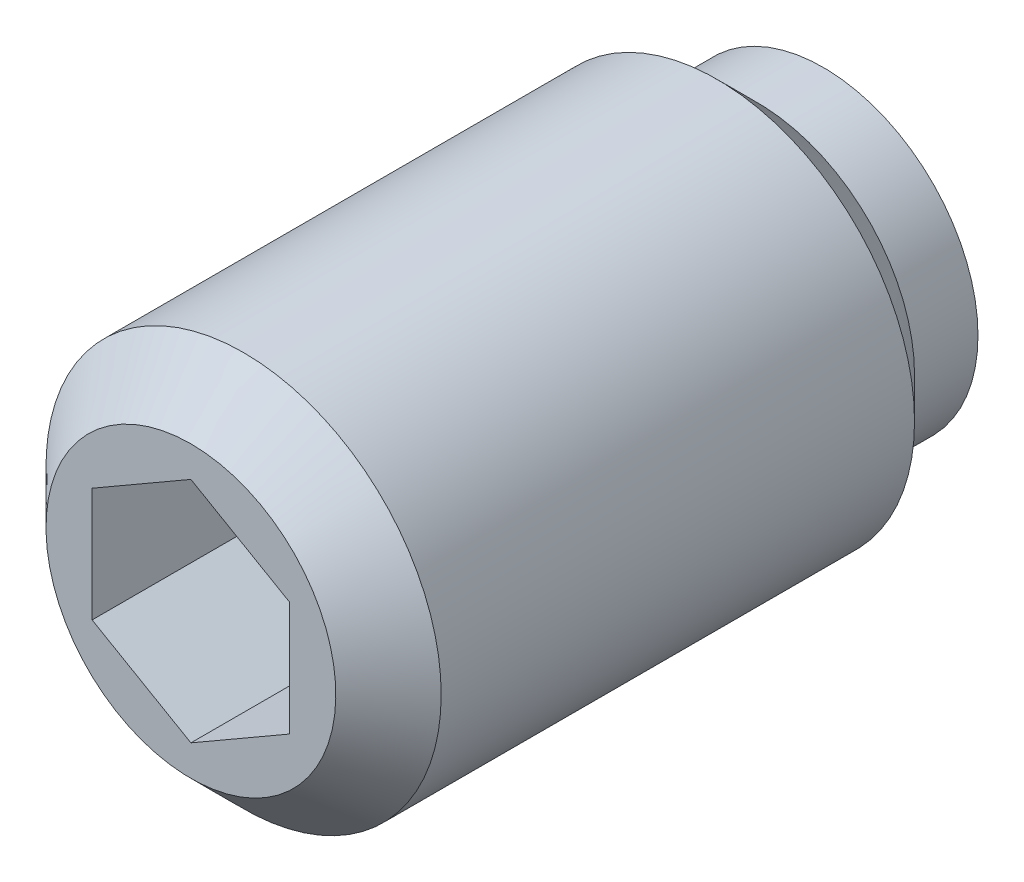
ISO-10303-21;
HEADER;
FILE_DESCRIPTION(('STEP AP214'),'2;1');
FILE_NAME('part.step','',(''),(''),'','','');
FILE_SCHEMA(('AUTOMOTIVE_DESIGN { 1 0 10303 214 1 1 1 1 }'));
ENDSEC;
DATA;
#1=APPLICATION_CONTEXT('core data for automotive mechanical design processes');
#2=APPLICATION_PROTOCOL_DEFINITION('international standard','automotive_design',2000,#1);
#3=PRODUCT_CONTEXT('',#1,'mechanical');
#4=PRODUCT('Part','Part','',(#3));
#5=PRODUCT_RELATED_PRODUCT_CATEGORY('part','',(#4));
#6=PRODUCT_DEFINITION_FORMATION('','',#4);
#7=PRODUCT_DEFINITION_CONTEXT('part definition',#1,'design');
#8=PRODUCT_DEFINITION('design','',#6,#7);
#9=PRODUCT_DEFINITION_SHAPE('','',#8);
#10=(LENGTH_UNIT() NAMED_UNIT(*) SI_UNIT(.MILLI.,.METRE.));
#11=(NAMED_UNIT(*) PLANE_ANGLE_UNIT() SI_UNIT($,.RADIAN.));
#12=(NAMED_UNIT(*) SI_UNIT($,.STERADIAN.) SOLID_ANGLE_UNIT());
#13=UNCERTAINTY_MEASURE_WITH_UNIT(LENGTH_MEASURE(1.E-05),#10,'distance_accuracy_value','');
#14=(GEOMETRIC_REPRESENTATION_CONTEXT(3) GLOBAL_UNCERTAINTY_ASSIGNED_CONTEXT((#13)) GLOBAL_UNIT_ASSIGNED_CONTEXT((#10,
#11,#12)) REPRESENTATION_CONTEXT('',''));
#15=CARTESIAN_POINT('',(0.,0.,0.));
#16=DIRECTION('',(0.,0.,1.));
#17=DIRECTION('',(1.,0.,0.));
#18=AXIS2_PLACEMENT_3D('',#15,#16,#17);
#19=CARTESIAN_POINT('',(1.5,-0.866025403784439,7.3));
#20=DIRECTION('',(-0.5,0.866025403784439,0.));
#21=DIRECTION('',(0.866025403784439,0.5,0.));
#22=AXIS2_PLACEMENT_3D('',#19,#20,#21);
#23=PLANE('',#22);
#24=DIRECTION('',(0.866025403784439,0.5,0.));
#25=VECTOR('',#24,1.);
#26=CARTESIAN_POINT('',(1.5,-0.866025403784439,7.3));
#27=LINE('',#26,#25);
#28=CARTESIAN_POINT('',(1.5,-0.866025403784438,7.3));
#29=VERTEX_POINT('',#28);
#30=CARTESIAN_POINT('',(0.,-1.73205080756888,7.3));
#31=VERTEX_POINT('',#30);
#32=EDGE_CURVE('E88',#29,#31,#27,.F.);
#33=ORIENTED_EDGE('',*,*,#32,.T.);
#34=DIRECTION('',(0.,0.,-1.));
#35=VECTOR('',#34,1.);
#36=CARTESIAN_POINT('',(0.,-1.73205080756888,7.3));
#37=LINE('',#36,#35);
#38=CARTESIAN_POINT('',(0.,-1.73205080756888,10.8));
#39=VERTEX_POINT('',#38);
#40=EDGE_CURVE('E86',#39,#31,#37,.T.);
#41=ORIENTED_EDGE('',*,*,#40,.F.);
#42=DIRECTION('',(0.866025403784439,0.5,0.));
#43=VECTOR('',#42,1.);
#44=CARTESIAN_POINT('',(1.5,-0.866025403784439,10.8));
#45=LINE('',#44,#43);
#46=CARTESIAN_POINT('',(1.5,-0.866025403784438,10.8));
#47=VERTEX_POINT('',#46);
#48=EDGE_CURVE('E71',#39,#47,#45,.T.);
#49=ORIENTED_EDGE('',*,*,#48,.T.);
#50=DIRECTION('',(0.,0.,1.));
#51=VECTOR('',#50,1.);
#52=CARTESIAN_POINT('',(1.5,-0.866025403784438,7.3));
#53=LINE('',#52,#51);
#54=EDGE_CURVE('E83',#29,#47,#53,.T.);
#55=ORIENTED_EDGE('',*,*,#54,.F.);
#56=EDGE_LOOP('',(#33,#41,#49,#55));
#57=FACE_BOUND('',#56,.T.);
#58=ADVANCED_FACE('F14',(#57),#23,.T.);
#59=CARTESIAN_POINT('',(0.,-1.73205080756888,7.3));
#60=DIRECTION('',(0.5,0.866025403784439,0.));
#61=DIRECTION('',(0.866025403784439,-0.5,0.));
#62=AXIS2_PLACEMENT_3D('',#59,#60,#61);
#63=PLANE('',#62);
#64=DIRECTION('',(-0.866025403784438,0.5,0.));
#65=VECTOR('',#64,1.);
#66=CARTESIAN_POINT('',(-0.75,-1.29903810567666,7.3));
#67=LINE('',#66,#65);
#68=CARTESIAN_POINT('',(-1.5,-0.866025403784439,7.3));
#69=VERTEX_POINT('',#68);
#70=EDGE_CURVE('E78',#31,#69,#67,.T.);
#71=ORIENTED_EDGE('',*,*,#70,.T.);
#72=DIRECTION('',(0.,0.,-1.));
#73=VECTOR('',#72,1.);
#74=CARTESIAN_POINT('',(-1.5,-0.866025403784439,7.3));
#75=LINE('',#74,#73);
#76=CARTESIAN_POINT('',(-1.5,-0.86602540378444,10.8));
#77=VERTEX_POINT('',#76);
#78=EDGE_CURVE('E95',#77,#69,#75,.T.);
#79=ORIENTED_EDGE('',*,*,#78,.F.);
#80=DIRECTION('',(0.866025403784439,-0.5,0.));
#81=VECTOR('',#80,1.);
#82=CARTESIAN_POINT('',(0.,-1.73205080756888,10.8));
#83=LINE('',#82,#81);
#84=EDGE_CURVE('E101',#77,#39,#83,.T.);
#85=ORIENTED_EDGE('',*,*,#84,.T.);
#86=ORIENTED_EDGE('',*,*,#40,.T.);
#87=EDGE_LOOP('',(#71,#79,#85,#86));
#88=FACE_BOUND('',#87,.T.);
#89=ADVANCED_FACE('F140',(#88),#63,.T.);
#90=CARTESIAN_POINT('',(1.5,0.866025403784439,7.3));
#91=DIRECTION('',(-1.,0.,0.));
#92=DIRECTION('',(0.,0.,1.));
#93=AXIS2_PLACEMENT_3D('',#90,#91,#92);
#94=PLANE('',#93);
#95=DIRECTION('',(0.,1.,0.));
#96=VECTOR('',#95,1.);
#97=CARTESIAN_POINT('',(1.5,0.866025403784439,7.3));
#98=LINE('',#97,#96);
#99=CARTESIAN_POINT('',(1.5,0.866025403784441,7.3));
#100=VERTEX_POINT('',#99);
#101=EDGE_CURVE('E77',#100,#29,#98,.F.);
#102=ORIENTED_EDGE('',*,*,#101,.T.);
#103=ORIENTED_EDGE('',*,*,#54,.T.);
#104=DIRECTION('',(0.,1.,0.));
#105=VECTOR('',#104,1.);
#106=CARTESIAN_POINT('',(1.5,0.866025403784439,10.8));
#107=LINE('',#106,#105);
#108=CARTESIAN_POINT('',(1.5,0.86602540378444,10.8));
#109=VERTEX_POINT('',#108);
#110=EDGE_CURVE('E67',#47,#109,#107,.T.);
#111=ORIENTED_EDGE('',*,*,#110,.T.);
#112=DIRECTION('',(0.,0.,-1.));
#113=VECTOR('',#112,1.);
#114=CARTESIAN_POINT('',(1.5,0.866025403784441,7.3));
#115=LINE('',#114,#113);
#116=EDGE_CURVE('E133',#100,#109,#115,.F.);
#117=ORIENTED_EDGE('',*,*,#116,.F.);
#118=EDGE_LOOP('',(#102,#103,#111,#117));
#119=FACE_BOUND('',#118,.T.);
#120=ADVANCED_FACE('F91',(#119),#94,.T.);
#121=CARTESIAN_POINT('',(0.,2.35,1.2));
#122=DIRECTION('',(0.,0.,1.));
#123=DIRECTION('',(1.,0.,0.));
#124=AXIS2_PLACEMENT_3D('',#121,#122,#123);
#125=PLANE('',#124);
#126=CARTESIAN_POINT('',(0.,0.,1.2));
#127=DIRECTION('',(0.,0.,1.));
#128=DIRECTION('',(1.,0.,0.));
#129=AXIS2_PLACEMENT_3D('',#126,#127,#128);
#130=CIRCLE('',#129,2.35);
#131=CARTESIAN_POINT('',(2.35,0.,1.2));
#132=VERTEX_POINT('',#131);
#133=EDGE_CURVE('E20',#132,#132,#130,.T.);
#134=ORIENTED_EDGE('',*,*,#133,.F.);
#135=EDGE_LOOP('',(#134));
#136=FACE_BOUND('',#135,.T.);
#137=CARTESIAN_POINT('',(1.83303027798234,0.,1.2));
#138=CARTESIAN_POINT('',(1.83302571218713,-0.102962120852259,1.2));
#139=CARTESIAN_POINT('',(1.82432602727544,-0.205998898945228,1.2));
#140=CARTESIAN_POINT('',(1.78974198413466,-0.409234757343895,1.2));
#141=CARTESIAN_POINT('',(1.76383694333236,-0.509430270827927,1.20000000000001));
#142=CARTESIAN_POINT('',(1.69557964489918,-0.704009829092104,1.20000000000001));
#143=CARTESIAN_POINT('',(1.65323524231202,-0.79839662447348,1.2));
#144=CARTESIAN_POINT('',(1.55331201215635,-0.978695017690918,1.2));
#145=CARTESIAN_POINT('',(1.49573697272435,-1.06460871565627,1.2));
#146=CARTESIAN_POINT('',(1.36697518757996,-1.22556138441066,1.2));
#147=CARTESIAN_POINT('',(1.29578701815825,-1.30059921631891,1.2));
#148=CARTESIAN_POINT('',(1.1418204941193,-1.43766111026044,1.2));
#149=CARTESIAN_POINT('',(1.05904168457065,-1.49968466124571,1.19999999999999));
#150=CARTESIAN_POINT('',(0.884247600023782,-1.60895278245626,1.19999999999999));
#151=CARTESIAN_POINT('',(0.792232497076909,-1.65619762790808,1.2));
#152=CARTESIAN_POINT('',(0.601576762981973,-1.73456861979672,1.2));
#153=CARTESIAN_POINT('',(0.502936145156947,-1.76569479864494,1.2));
#154=CARTESIAN_POINT('',(0.301829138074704,-1.8109450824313,1.2));
#155=CARTESIAN_POINT('',(0.19936274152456,-1.82506915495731,1.2));
#156=CARTESIAN_POINT('',(-0.00648673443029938,-1.83591416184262,1.2));
#157=CARTESIAN_POINT('',(-0.109869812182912,-1.8326351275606,1.2));
#158=CARTESIAN_POINT('',(-0.314618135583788,-1.80876707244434,1.2));
#159=CARTESIAN_POINT('',(-0.415983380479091,-1.78817804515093,1.2));
#160=CARTESIAN_POINT('',(-0.613818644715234,-1.73027442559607,1.2));
#161=CARTESIAN_POINT('',(-0.710288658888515,-1.69295981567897,1.2));
#162=CARTESIAN_POINT('',(-0.895594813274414,-1.60266429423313,1.2));
#163=CARTESIAN_POINT('',(-0.984430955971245,-1.54968338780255,1.2));
#164=CARTESIAN_POINT('',(-1.15194757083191,-1.4295592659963,1.2));
#165=CARTESIAN_POINT('',(-1.2306280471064,-1.36241605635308,1.2));
#166=CARTESIAN_POINT('',(-1.3755998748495,-1.21587330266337,1.2));
#167=CARTESIAN_POINT('',(-1.44189122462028,-1.13647375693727,1.2));
#168=CARTESIAN_POINT('',(-1.56020297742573,-0.967672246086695,1.2));
#169=CARTESIAN_POINT('',(-1.61222337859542,-0.878270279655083,1.2));
#170=CARTESIAN_POINT('',(-1.70051651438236,-0.692001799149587,1.2));
#171=CARTESIAN_POINT('',(-1.73678924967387,-0.595135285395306,1.2));
#172=CARTESIAN_POINT('',(-1.79255737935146,-0.396687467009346,1.2));
#173=CARTESIAN_POINT('',(-1.81205277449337,-0.295106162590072,1.2));
#174=CARTESIAN_POINT('',(-1.83371280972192,-0.0901123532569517,1.2));
#175=CARTESIAN_POINT('',(-1.83587744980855,0.0133001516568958,1.2));
#176=CARTESIAN_POINT('',(-1.82281452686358,0.219020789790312,1.2));
#177=CARTESIAN_POINT('',(-1.80758696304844,0.321328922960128,1.2));
#178=CARTESIAN_POINT('',(-1.76017189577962,0.521936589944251,1.2));
#179=CARTESIAN_POINT('',(-1.72798439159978,0.620236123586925,1.2));
#180=CARTESIAN_POINT('',(-1.64756315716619,0.810036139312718,1.2));
#181=CARTESIAN_POINT('',(-1.59932942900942,0.901536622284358,1.2));
#182=CARTESIAN_POINT('',(-1.48818496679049,1.07514110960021,1.2));
#183=CARTESIAN_POINT('',(-1.42527423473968,1.15724511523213,1.2));
#184=CARTESIAN_POINT('',(-1.28656158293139,1.30972600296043,1.2));
#185=CARTESIAN_POINT('',(-1.210759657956,1.38010288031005,1.2));
#186=CARTESIAN_POINT('',(-1.04841640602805,1.5071316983,1.2));
#187=CARTESIAN_POINT('',(-0.961875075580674,1.56378363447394,1.2));
#188=CARTESIAN_POINT('',(-0.780509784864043,1.66175430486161,1.2));
#189=CARTESIAN_POINT('',(-0.685685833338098,1.70307305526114,1.2));
#190=CARTESIAN_POINT('',(-0.490447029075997,1.76920450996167,1.2));
#191=CARTESIAN_POINT('',(-0.390032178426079,1.79401722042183,1.2));
#192=CARTESIAN_POINT('',(-0.18646183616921,1.82643228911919,1.2));
#193=CARTESIAN_POINT('',(-0.0833063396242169,1.83403461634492,1.2));
#194=CARTESIAN_POINT('',(0.122816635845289,1.83181302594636,1.2));
#195=CARTESIAN_POINT('',(0.225784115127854,1.82198914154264,1.2));
#196=CARTESIAN_POINT('',(0.428608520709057,1.78519400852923,1.2));
#197=CARTESIAN_POINT('',(0.528465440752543,1.75822272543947,1.2));
#198=CARTESIAN_POINT('',(0.722235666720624,1.68789780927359,1.2));
#199=CARTESIAN_POINT('',(0.816148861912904,1.64454387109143,1.2));
#200=CARTESIAN_POINT('',(0.99536008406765,1.54268617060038,1.2));
#201=CARTESIAN_POINT('',(1.08065844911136,1.48418300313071,1.20000000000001));
#202=CARTESIAN_POINT('',(1.24021445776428,1.35369454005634,1.19999999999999));
#203=CARTESIAN_POINT('',(1.31447325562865,1.28171065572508,1.19999999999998));
#204=CARTESIAN_POINT('',(1.44987060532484,1.12627668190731,1.20000000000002));
#205=CARTESIAN_POINT('',(1.5110058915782,1.04282374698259,1.20000000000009));
#206=CARTESIAN_POINT('',(1.6184211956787,0.866806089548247,1.20000000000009));
#207=CARTESIAN_POINT('',(1.66469410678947,0.774237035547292,1.20000000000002));
#208=CARTESIAN_POINT('',(1.7409888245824,0.582716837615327,1.19999999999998));
#209=CARTESIAN_POINT('',(1.77103011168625,0.483773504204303,1.19999999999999));
#210=CARTESIAN_POINT('',(1.8060021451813,0.320166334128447,1.2));
#211=CARTESIAN_POINT('',(1.81612504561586,0.256565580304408,1.2));
#212=CARTESIAN_POINT('',(1.82964053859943,0.128652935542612,1.2));
#213=CARTESIAN_POINT('',(1.83303313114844,0.0643410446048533,1.2));
#214=CARTESIAN_POINT('',(1.83303027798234,0.,1.2));
#215=B_SPLINE_CURVE_WITH_KNOTS('',3,(#137,#138,#139,#140,#141,#142,#143,#144,#145,#146,#147,
#148,#149,#150,#151,#152,#153,#154,#155,#156,#157,#158,#159,#160,#161,#162,#163,#164,#165,#166,
#167,#168,#169,#170,#171,#172,#173,#174,#175,#176,#177,#178,#179,#180,#181,#182,#183,#184,#185,
#186,#187,#188,#189,#190,#191,#192,#193,#194,#195,#196,#197,#198,#199,#200,#201,#202,#203,#204,
#205,#206,#207,#208,#209,#210,#211,#212,#213,#214),.UNSPECIFIED.,.T.,.F.,(4,2,2,2,2,2,2,2,2,2,2,
2,2,2,2,2,2,2,2,2,2,2,2,2,2,2,2,2,2,2,2,2,2,2,2,2,2,2,4),(0.,0.308651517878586,
0.617674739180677,0.926550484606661,1.23534947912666,1.54418078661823,1.85302421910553,
2.1618618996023,2.47069895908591,2.77953660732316,3.08837369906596,3.39721090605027,
3.70604843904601,4.01488587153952,4.32372317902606,4.63256052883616,4.94139791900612,
5.25023529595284,5.55907265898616,5.86791002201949,6.17674739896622,6.48558478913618,
6.79442213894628,7.10325944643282,7.41209687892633,7.72093441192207,8.02977161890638,
8.33860871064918,8.64744635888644,8.95628341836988,9.26512109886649,9.57396453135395,
9.88279583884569,10.1915948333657,10.5004705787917,10.8094938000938,11.1181453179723,
11.3110216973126,11.5038980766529),.UNSPECIFIED.);
#216=CARTESIAN_POINT('',(1.83303027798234,0.,1.2));
#217=VERTEX_POINT('',#216);
#218=EDGE_CURVE('E89',#217,#217,#215,.T.);
#219=ORIENTED_EDGE('',*,*,#218,.F.);
#220=EDGE_LOOP('',(#219));
#221=FACE_BOUND('',#220,.T.);
#222=ADVANCED_FACE('F251',(#136,#221),#125,.F.);
#223=CARTESIAN_POINT('',(-1.5,-0.866025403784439,7.3));
#224=DIRECTION('',(1.,0.,0.));
#225=DIRECTION('',(0.,0.,-1.));
#226=AXIS2_PLACEMENT_3D('',#223,#224,#225);
#227=PLANE('',#226);
#228=DIRECTION('',(0.,1.,0.));
#229=VECTOR('',#228,1.);
#230=CARTESIAN_POINT('',(-1.5,0.,7.3));
#231=LINE('',#230,#229);
#232=CARTESIAN_POINT('',(-1.5,0.866025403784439,7.3));
#233=VERTEX_POINT('',#232);
#234=EDGE_CURVE('E125',#69,#233,#231,.T.);
#235=ORIENTED_EDGE('',*,*,#234,.T.);
#236=DIRECTION('',(0.,0.,-1.));
#237=VECTOR('',#236,1.);
#238=CARTESIAN_POINT('',(-1.5,0.866025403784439,7.3));
#239=LINE('',#238,#237);
#240=CARTESIAN_POINT('',(-1.5,0.866025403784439,10.8));
#241=VERTEX_POINT('',#240);
#242=EDGE_CURVE('E121',#241,#233,#239,.T.);
#243=ORIENTED_EDGE('',*,*,#242,.F.);
#244=DIRECTION('',(0.,1.,0.));
#245=VECTOR('',#244,1.);
#246=CARTESIAN_POINT('',(-1.5,-0.866025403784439,10.8));
#247=LINE('',#246,#245);
#248=EDGE_CURVE('E92',#241,#77,#247,.F.);
#249=ORIENTED_EDGE('',*,*,#248,.T.);
#250=ORIENTED_EDGE('',*,*,#78,.T.);
#251=EDGE_LOOP('',(#235,#243,#249,#250));
#252=FACE_BOUND('',#251,.T.);
#253=ADVANCED_FACE('F143',(#252),#227,.T.);
#254=CARTESIAN_POINT('',(0.,0.,7.3));
#255=DIRECTION('',(0.,0.,-1.));
#256=DIRECTION('',(-1.,0.,0.));
#257=AXIS2_PLACEMENT_3D('',#254,#255,#256);
#258=PLANE('',#257);
#259=DIRECTION('',(-0.866025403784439,0.5,0.));
#260=VECTOR('',#259,1.);
#261=CARTESIAN_POINT('',(0.,1.73205080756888,7.3));
#262=LINE('',#261,#260);
#263=CARTESIAN_POINT('',(0.,1.73205080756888,7.3));
#264=VERTEX_POINT('',#263);
#265=EDGE_CURVE('E130',#264,#100,#262,.F.);
#266=ORIENTED_EDGE('',*,*,#265,.F.);
#267=DIRECTION('',(-0.866025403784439,-0.5,0.));
#268=VECTOR('',#267,1.);
#269=CARTESIAN_POINT('',(-1.5,0.866025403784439,7.3));
#270=LINE('',#269,#268);
#271=EDGE_CURVE('E117',#233,#264,#270,.F.);
#272=ORIENTED_EDGE('',*,*,#271,.F.);
#273=ORIENTED_EDGE('',*,*,#234,.F.);
#274=ORIENTED_EDGE('',*,*,#70,.F.);
#275=ORIENTED_EDGE('',*,*,#32,.F.);
#276=ORIENTED_EDGE('',*,*,#101,.F.);
#277=EDGE_LOOP('',(#266,#272,#273,#274,#275,#276));
#278=FACE_BOUND('',#277,.T.);
#279=ADVANCED_FACE('F235',(#278),#258,.F.);
#280=CARTESIAN_POINT('',(0.,1.73205080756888,7.3));
#281=DIRECTION('',(-0.5,-0.866025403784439,0.));
#282=DIRECTION('',(-0.866025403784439,0.5,0.));
#283=AXIS2_PLACEMENT_3D('',#280,#281,#282);
#284=PLANE('',#283);
#285=ORIENTED_EDGE('',*,*,#265,.T.);
#286=ORIENTED_EDGE('',*,*,#116,.T.);
#287=DIRECTION('',(-0.866025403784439,0.5,0.));
#288=VECTOR('',#287,1.);
#289=CARTESIAN_POINT('',(0.,1.73205080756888,10.8));
#290=LINE('',#289,#288);
#291=CARTESIAN_POINT('',(0.,1.73205080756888,10.8));
#292=VERTEX_POINT('',#291);
#293=EDGE_CURVE('E35',#109,#292,#290,.T.);
#294=ORIENTED_EDGE('',*,*,#293,.T.);
#295=DIRECTION('',(0.,0.,-1.));
#296=VECTOR('',#295,1.);
#297=CARTESIAN_POINT('',(0.,1.73205080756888,7.3));
#298=LINE('',#297,#296);
#299=EDGE_CURVE('E112',#264,#292,#298,.F.);
#300=ORIENTED_EDGE('',*,*,#299,.F.);
#301=EDGE_LOOP('',(#285,#286,#294,#300));
#302=FACE_BOUND('',#301,.T.);
#303=ADVANCED_FACE('F156',(#302),#284,.T.);
#304=CARTESIAN_POINT('',(0.,0.,1.2));
#305=DIRECTION('',(0.,0.,1.));
#306=DIRECTION('',(1.,0.,0.));
#307=AXIS2_PLACEMENT_3D('',#304,#305,#306);
#308=CYLINDRICAL_SURFACE('',#307,2.35);
#309=CARTESIAN_POINT('',(0.,0.,2.2));
#310=DIRECTION('',(0.,0.,1.));
#311=DIRECTION('',(1.,0.,0.));
#312=AXIS2_PLACEMENT_3D('',#309,#310,#311);
#313=CIRCLE('',#312,2.35);
#314=CARTESIAN_POINT('',(2.35,0.,2.2));
#315=VERTEX_POINT('',#314);
#316=EDGE_CURVE('E110',#315,#315,#313,.F.);
#317=ORIENTED_EDGE('',*,*,#316,.T.);
#318=EDGE_LOOP('',(#317));
#319=FACE_BOUND('',#318,.T.);
#320=ORIENTED_EDGE('',*,*,#133,.T.);
#321=EDGE_LOOP('',(#320));
#322=FACE_BOUND('',#321,.T.);
#323=ADVANCED_FACE('F147',(#319,#322),#308,.T.);
#324=CARTESIAN_POINT('',(-1.5,0.866025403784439,7.3));
#325=DIRECTION('',(0.5,-0.866025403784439,0.));
#326=DIRECTION('',(-0.866025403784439,-0.5,0.));
#327=AXIS2_PLACEMENT_3D('',#324,#325,#326);
#328=PLANE('',#327);
#329=ORIENTED_EDGE('',*,*,#271,.T.);
#330=ORIENTED_EDGE('',*,*,#299,.T.);
#331=DIRECTION('',(-0.866025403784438,-0.5,0.));
#332=VECTOR('',#331,1.);
#333=CARTESIAN_POINT('',(0.,1.73205080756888,10.8));
#334=LINE('',#333,#332);
#335=EDGE_CURVE('E109',#292,#241,#334,.T.);
#336=ORIENTED_EDGE('',*,*,#335,.T.);
#337=ORIENTED_EDGE('',*,*,#242,.T.);
#338=EDGE_LOOP('',(#329,#330,#336,#337));
#339=FACE_BOUND('',#338,.T.);
#340=ADVANCED_FACE('F144',(#339),#328,.T.);
#341=CARTESIAN_POINT('',(0.,2.3865,2.2));
#342=DIRECTION('',(0.,0.,1.));
#343=DIRECTION('',(1.,0.,0.));
#344=AXIS2_PLACEMENT_3D('',#341,#342,#343);
#345=PLANE('',#344);
#346=CARTESIAN_POINT('',(0.,0.,2.19999999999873));
#347=DIRECTION('',(0.,0.,1.));
#348=DIRECTION('',(1.,0.,0.));
#349=AXIS2_PLACEMENT_3D('',#346,#347,#348);
#350=CIRCLE('',#349,2.38650000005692);
#351=CARTESIAN_POINT('',(2.38650000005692,0.,2.19999999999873));
#352=VERTEX_POINT('',#351);
#353=EDGE_CURVE('E107',#352,#352,#350,.T.);
#354=ORIENTED_EDGE('',*,*,#353,.F.);
#355=EDGE_LOOP('',(#354));
#356=FACE_BOUND('',#355,.T.);
#357=ORIENTED_EDGE('',*,*,#316,.F.);
#358=EDGE_LOOP('',(#357));
#359=FACE_BOUND('',#358,.T.);
#360=ADVANCED_FACE('F146',(#356,#359),#345,.F.);
#361=CARTESIAN_POINT('',(0.,0.,10.8));
#362=DIRECTION('',(0.,0.,-1.));
#363=DIRECTION('',(-1.,0.,0.));
#364=AXIS2_PLACEMENT_3D('',#361,#362,#363);
#365=PLANE('',#364);
#366=ORIENTED_EDGE('',*,*,#293,.F.);
#367=ORIENTED_EDGE('',*,*,#110,.F.);
#368=ORIENTED_EDGE('',*,*,#48,.F.);
#369=ORIENTED_EDGE('',*,*,#84,.F.);
#370=ORIENTED_EDGE('',*,*,#248,.F.);
#371=ORIENTED_EDGE('',*,*,#335,.F.);
#372=EDGE_LOOP('',(#366,#367,#368,#369,#370,#371));
#373=FACE_BOUND('',#372,.T.);
#374=CARTESIAN_POINT('',(0.,0.,10.8));
#375=DIRECTION('',(0.,0.,-1.));
#376=DIRECTION('',(0.,1.,0.));
#377=AXIS2_PLACEMENT_3D('',#374,#375,#376);
#378=CIRCLE('',#377,2.20000000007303);
#379=CARTESIAN_POINT('',(0.,2.20000000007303,10.8));
#380=VERTEX_POINT('',#379);
#381=EDGE_CURVE('E104',#380,#380,#378,.T.);
#382=ORIENTED_EDGE('',*,*,#381,.F.);
#383=EDGE_LOOP('',(#382));
#384=FACE_BOUND('',#383,.T.);
#385=ADVANCED_FACE('F69',(#373,#384),#365,.F.);
#386=CARTESIAN_POINT('',(0.,0.,2.81349999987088));
#387=DIRECTION('',(0.,0.,1.));
#388=DIRECTION('',(1.,0.,0.));
#389=AXIS2_PLACEMENT_3D('',#386,#387,#388);
#390=CONICAL_SURFACE('',#389,2.99999999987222,0.785398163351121);
#391=CARTESIAN_POINT('',(0.,0.,2.8135));
#392=DIRECTION('',(0.,0.,1.));
#393=DIRECTION('',(1.,0.,0.));
#394=AXIS2_PLACEMENT_3D('',#391,#392,#393);
#395=CIRCLE('',#394,3.);
#396=CARTESIAN_POINT('',(3.,0.,2.8135));
#397=VERTEX_POINT('',#396);
#398=EDGE_CURVE('E26',#397,#397,#395,.T.);
#399=ORIENTED_EDGE('',*,*,#398,.F.);
#400=EDGE_LOOP('',(#399));
#401=FACE_BOUND('',#400,.T.);
#402=ORIENTED_EDGE('',*,*,#353,.T.);
#403=EDGE_LOOP('',(#402));
#404=FACE_BOUND('',#403,.T.);
#405=ADVANCED_FACE('F168',(#401,#404),#390,.T.);
#406=CARTESIAN_POINT('',(0.,0.,10.0000000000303));
#407=DIRECTION('',(0.,0.,-1.));
#408=DIRECTION('',(0.,1.,0.));
#409=AXIS2_PLACEMENT_3D('',#406,#407,#408);
#410=CONICAL_SURFACE('',#409,3.00000000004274,0.785398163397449);
#411=ORIENTED_EDGE('',*,*,#381,.T.);
#412=EDGE_LOOP('',(#411));
#413=FACE_BOUND('',#412,.T.);
#414=CARTESIAN_POINT('',(0.,0.,10.));
#415=DIRECTION('',(0.,0.,1.));
#416=DIRECTION('',(1.,0.,0.));
#417=AXIS2_PLACEMENT_3D('',#414,#415,#416);
#418=CIRCLE('',#417,3.);
#419=CARTESIAN_POINT('',(3.,0.,10.));
#420=VERTEX_POINT('',#419);
#421=EDGE_CURVE('E9',#420,#420,#418,.F.);
#422=ORIENTED_EDGE('',*,*,#421,.F.);
#423=EDGE_LOOP('',(#422));
#424=FACE_BOUND('',#423,.T.);
#425=ADVANCED_FACE('F160',(#413,#424),#410,.T.);
#426=CARTESIAN_POINT('',(0.,0.,1.2));
#427=DIRECTION('',(0.,0.,1.));
#428=DIRECTION('',(1.,0.,0.));
#429=AXIS2_PLACEMENT_3D('',#426,#427,#428);
#430=CYLINDRICAL_SURFACE('',#429,3.);
#431=ORIENTED_EDGE('',*,*,#421,.T.);
#432=EDGE_LOOP('',(#431));
#433=FACE_BOUND('',#432,.T.);
#434=ORIENTED_EDGE('',*,*,#398,.T.);
#435=EDGE_LOOP('',(#434));
#436=FACE_BOUND('',#435,.T.);
#437=ADVANCED_FACE('F158',(#433,#436),#430,.T.);
#438=CARTESIAN_POINT('',(0.,0.,2.));
#439=DIRECTION('',(-1.,0.,0.));
#440=DIRECTION('',(0.,0.,1.));
#441=AXIS2_PLACEMENT_3D('',#438,#439,#440);
#442=SPHERICAL_SURFACE('',#441,2.);
#443=ORIENTED_EDGE('',*,*,#218,.T.);
#444=EDGE_LOOP('',(#443));
#445=FACE_BOUND('',#444,.T.);
#446=ADVANCED_FACE('F16',(#445),#442,.T.);
#447=CLOSED_SHELL('',(#58,#89,#120,#222,#253,#279,#303,#323,#340,#360,#385,#405,#425,#437,#446));
#448=MANIFOLD_SOLID_BREP('B1',#447);
#449=ADVANCED_BREP_SHAPE_REPRESENTATION('',(#18,#448),#14);
#450=SHAPE_DEFINITION_REPRESENTATION(#9,#449);
ENDSEC;
END-ISO-10303-21;
